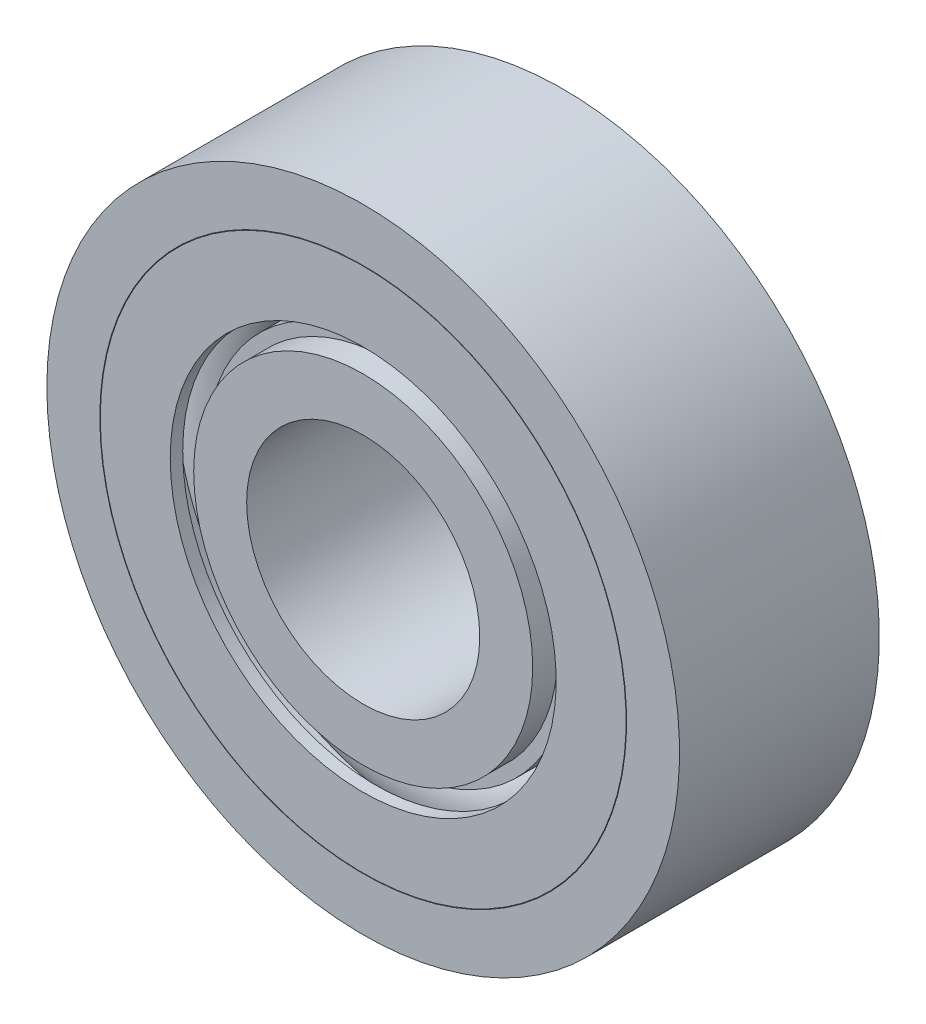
ISO-10303-21;
HEADER;
FILE_DESCRIPTION(('STEP AP214'),'2;1');
FILE_NAME('part.step','',(''),(''),'','','');
FILE_SCHEMA(('AUTOMOTIVE_DESIGN { 1 0 10303 214 1 1 1 1 }'));
ENDSEC;
DATA;
#1=APPLICATION_CONTEXT('core data for automotive mechanical design processes');
#2=APPLICATION_PROTOCOL_DEFINITION('international standard','automotive_design',2000,#1);
#3=PRODUCT_CONTEXT('',#1,'mechanical');
#4=PRODUCT('Part','Part','',(#3));
#5=PRODUCT_RELATED_PRODUCT_CATEGORY('part','',(#4));
#6=PRODUCT_DEFINITION_FORMATION('','',#4);
#7=PRODUCT_DEFINITION_CONTEXT('part definition',#1,'design');
#8=PRODUCT_DEFINITION('design','',#6,#7);
#9=PRODUCT_DEFINITION_SHAPE('','',#8);
#10=(LENGTH_UNIT() NAMED_UNIT(*) SI_UNIT(.MILLI.,.METRE.));
#11=(NAMED_UNIT(*) PLANE_ANGLE_UNIT() SI_UNIT($,.RADIAN.));
#12=(NAMED_UNIT(*) SI_UNIT($,.STERADIAN.) SOLID_ANGLE_UNIT());
#13=UNCERTAINTY_MEASURE_WITH_UNIT(LENGTH_MEASURE(1.E-05),#10,'distance_accuracy_value','');
#14=(GEOMETRIC_REPRESENTATION_CONTEXT(3) GLOBAL_UNCERTAINTY_ASSIGNED_CONTEXT((#13)) GLOBAL_UNIT_ASSIGNED_CONTEXT((#10,
#11,#12)) REPRESENTATION_CONTEXT('',''));
#15=CARTESIAN_POINT('',(0.,0.,0.));
#16=DIRECTION('',(0.,0.,1.));
#17=DIRECTION('',(1.,0.,0.));
#18=AXIS2_PLACEMENT_3D('',#15,#16,#17);
#19=CARTESIAN_POINT('',(0.,0.,3.3));
#20=DIRECTION('',(0.,0.,-1.));
#21=DIRECTION('',(-1.,0.,0.));
#22=AXIS2_PLACEMENT_3D('',#19,#20,#21);
#23=CYLINDRICAL_SURFACE('',#22,3.5);
#24=CARTESIAN_POINT('',(0.,0.,3.));
#25=DIRECTION('',(0.,0.,-1.));
#26=DIRECTION('',(-1.,0.,0.));
#27=AXIS2_PLACEMENT_3D('',#24,#25,#26);
#28=CIRCLE('',#27,3.5);
#29=CARTESIAN_POINT('',(-3.5,0.,3.));
#30=VERTEX_POINT('',#29);
#31=EDGE_CURVE('P0_E18',#30,#30,#28,.F.);
#32=ORIENTED_EDGE('',*,*,#31,.T.);
#33=EDGE_LOOP('',(#32));
#34=FACE_BOUND('',#33,.T.);
#35=CARTESIAN_POINT('',(0.,0.,-3.));
#36=DIRECTION('',(0.,0.,-1.));
#37=DIRECTION('',(-1.,0.,0.));
#38=AXIS2_PLACEMENT_3D('',#35,#36,#37);
#39=CIRCLE('',#38,3.5);
#40=CARTESIAN_POINT('',(-3.5,0.,-3.));
#41=VERTEX_POINT('',#40);
#42=EDGE_CURVE('P0_E68',#41,#41,#39,.F.);
#43=ORIENTED_EDGE('',*,*,#42,.F.);
#44=EDGE_LOOP('',(#43));
#45=FACE_BOUND('',#44,.T.);
#46=ADVANCED_FACE('P0_F15',(#34,#45),#23,.F.);
#47=CARTESIAN_POINT('',(0.,0.,3.));
#48=DIRECTION('',(0.,0.,-1.));
#49=DIRECTION('',(-1.,0.,0.));
#50=AXIS2_PLACEMENT_3D('',#47,#48,#49);
#51=PLANE('',#50);
#52=CARTESIAN_POINT('',(0.,0.,3.));
#53=DIRECTION('',(0.,0.,-1.));
#54=DIRECTION('',(-1.,0.,0.));
#55=AXIS2_PLACEMENT_3D('',#52,#53,#54);
#56=CIRCLE('',#55,5.09);
#57=CARTESIAN_POINT('',(-5.09,0.,3.));
#58=VERTEX_POINT('',#57);
#59=EDGE_CURVE('P0_E66',#58,#58,#56,.T.);
#60=ORIENTED_EDGE('',*,*,#59,.F.);
#61=EDGE_LOOP('',(#60));
#62=FACE_BOUND('',#61,.T.);
#63=ORIENTED_EDGE('',*,*,#31,.F.);
#64=EDGE_LOOP('',(#63));
#65=FACE_BOUND('',#64,.T.);
#66=ADVANCED_FACE('P0_F77',(#62,#65),#51,.F.);
#67=CARTESIAN_POINT('',(0.,0.,-3.));
#68=DIRECTION('',(0.,0.,-1.));
#69=DIRECTION('',(-1.,0.,0.));
#70=AXIS2_PLACEMENT_3D('',#67,#68,#69);
#71=PLANE('',#70);
#72=CARTESIAN_POINT('',(0.,0.,-3.));
#73=DIRECTION('',(0.,0.,-1.));
#74=DIRECTION('',(-1.,0.,0.));
#75=AXIS2_PLACEMENT_3D('',#72,#73,#74);
#76=CIRCLE('',#75,5.09);
#77=CARTESIAN_POINT('',(-5.09,0.,-3.));
#78=VERTEX_POINT('',#77);
#79=EDGE_CURVE('P0_E63',#78,#78,#76,.F.);
#80=ORIENTED_EDGE('',*,*,#79,.F.);
#81=EDGE_LOOP('',(#80));
#82=FACE_BOUND('',#81,.T.);
#83=ORIENTED_EDGE('',*,*,#42,.T.);
#84=EDGE_LOOP('',(#83));
#85=FACE_BOUND('',#84,.T.);
#86=ADVANCED_FACE('P0_F79',(#82,#85),#71,.T.);
#87=CARTESIAN_POINT('',(0.,0.,3.3));
#88=DIRECTION('',(0.,0.,-1.));
#89=DIRECTION('',(-1.,0.,0.));
#90=AXIS2_PLACEMENT_3D('',#87,#88,#89);
#91=CYLINDRICAL_SURFACE('',#90,5.09);
#92=ORIENTED_EDGE('',*,*,#59,.T.);
#93=EDGE_LOOP('',(#92));
#94=FACE_BOUND('',#93,.T.);
#95=CARTESIAN_POINT('',(0.,0.,2.25));
#96=DIRECTION('',(0.,0.,-1.));
#97=DIRECTION('',(-1.,0.,0.));
#98=AXIS2_PLACEMENT_3D('',#95,#96,#97);
#99=CIRCLE('',#98,5.09);
#100=CARTESIAN_POINT('',(-5.09,0.,2.25));
#101=VERTEX_POINT('',#100);
#102=EDGE_CURVE('P0_E60',#101,#101,#99,.F.);
#103=ORIENTED_EDGE('',*,*,#102,.T.);
#104=EDGE_LOOP('',(#103));
#105=FACE_BOUND('',#104,.T.);
#106=ADVANCED_FACE('P0_F86',(#94,#105),#91,.T.);
#107=CARTESIAN_POINT('',(0.,0.,3.3));
#108=DIRECTION('',(0.,0.,-1.));
#109=DIRECTION('',(-1.,0.,0.));
#110=AXIS2_PLACEMENT_3D('',#107,#108,#109);
#111=CYLINDRICAL_SURFACE('',#110,5.09);
#112=ORIENTED_EDGE('',*,*,#79,.T.);
#113=EDGE_LOOP('',(#112));
#114=FACE_BOUND('',#113,.T.);
#115=CARTESIAN_POINT('',(0.,0.,-2.25));
#116=DIRECTION('',(0.,0.,-1.));
#117=DIRECTION('',(-1.,0.,0.));
#118=AXIS2_PLACEMENT_3D('',#115,#116,#117);
#119=CIRCLE('',#118,5.09);
#120=CARTESIAN_POINT('',(-5.09,0.,-2.25));
#121=VERTEX_POINT('',#120);
#122=EDGE_CURVE('P0_E57',#121,#121,#119,.F.);
#123=ORIENTED_EDGE('',*,*,#122,.F.);
#124=EDGE_LOOP('',(#123));
#125=FACE_BOUND('',#124,.T.);
#126=ADVANCED_FACE('P0_F173',(#114,#125),#111,.T.);
#127=CARTESIAN_POINT('',(0.,0.,2.25));
#128=DIRECTION('',(0.,0.,-1.));
#129=DIRECTION('',(-1.,0.,0.));
#130=AXIS2_PLACEMENT_3D('',#127,#128,#129);
#131=PLANE('',#130);
#132=CARTESIAN_POINT('',(0.,0.,2.25));
#133=DIRECTION('',(0.,0.,-1.));
#134=DIRECTION('',(-1.,0.,0.));
#135=AXIS2_PLACEMENT_3D('',#132,#133,#134);
#136=CIRCLE('',#135,5.456);
#137=CARTESIAN_POINT('',(-5.456,0.,2.25));
#138=VERTEX_POINT('',#137);
#139=EDGE_CURVE('P0_E54',#138,#138,#136,.T.);
#140=ORIENTED_EDGE('',*,*,#139,.F.);
#141=EDGE_LOOP('',(#140));
#142=FACE_BOUND('',#141,.T.);
#143=ORIENTED_EDGE('',*,*,#102,.F.);
#144=EDGE_LOOP('',(#143));
#145=FACE_BOUND('',#144,.T.);
#146=ADVANCED_FACE('P0_F167',(#142,#145),#131,.F.);
#147=CARTESIAN_POINT('',(0.,0.,-2.25));
#148=DIRECTION('',(0.,0.,-1.));
#149=DIRECTION('',(-1.,0.,0.));
#150=AXIS2_PLACEMENT_3D('',#147,#148,#149);
#151=PLANE('',#150);
#152=CARTESIAN_POINT('',(0.,0.,-2.25));
#153=DIRECTION('',(0.,0.,-1.));
#154=DIRECTION('',(-1.,0.,0.));
#155=AXIS2_PLACEMENT_3D('',#152,#153,#154);
#156=CIRCLE('',#155,5.456);
#157=CARTESIAN_POINT('',(-5.456,0.,-2.25));
#158=VERTEX_POINT('',#157);
#159=EDGE_CURVE('P0_E51',#158,#158,#156,.F.);
#160=ORIENTED_EDGE('',*,*,#159,.F.);
#161=EDGE_LOOP('',(#160));
#162=FACE_BOUND('',#161,.T.);
#163=ORIENTED_EDGE('',*,*,#122,.T.);
#164=EDGE_LOOP('',(#163));
#165=FACE_BOUND('',#164,.T.);
#166=ADVANCED_FACE('P0_F159',(#162,#165),#151,.T.);
#167=CARTESIAN_POINT('',(0.,0.,3.3));
#168=DIRECTION('',(0.,0.,-1.));
#169=DIRECTION('',(-1.,0.,0.));
#170=AXIS2_PLACEMENT_3D('',#167,#168,#169);
#171=CYLINDRICAL_SURFACE('',#170,5.456);
#172=ORIENTED_EDGE('',*,*,#139,.T.);
#173=EDGE_LOOP('',(#172));
#174=FACE_BOUND('',#173,.T.);
#175=CARTESIAN_POINT('',(0.,0.,1.09094637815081));
#176=DIRECTION('',(0.,0.,-1.));
#177=DIRECTION('',(0.,-1.,0.));
#178=AXIS2_PLACEMENT_3D('',#175,#176,#177);
#179=CIRCLE('',#178,5.45600000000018);
#180=CARTESIAN_POINT('',(0.,-5.45600000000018,1.09094637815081));
#181=VERTEX_POINT('',#180);
#182=EDGE_CURVE('P0_E30',#181,#181,#179,.T.);
#183=ORIENTED_EDGE('',*,*,#182,.F.);
#184=EDGE_LOOP('',(#183));
#185=FACE_BOUND('',#184,.T.);
#186=ADVANCED_FACE('P0_F156',(#174,#185),#171,.T.);
#187=CARTESIAN_POINT('',(0.,0.,3.3));
#188=DIRECTION('',(0.,0.,-1.));
#189=DIRECTION('',(-1.,0.,0.));
#190=AXIS2_PLACEMENT_3D('',#187,#188,#189);
#191=CYLINDRICAL_SURFACE('',#190,5.456);
#192=CARTESIAN_POINT('',(0.,0.,-1.09094637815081));
#193=DIRECTION('',(0.,0.,-1.));
#194=DIRECTION('',(0.,-1.,0.));
#195=AXIS2_PLACEMENT_3D('',#192,#193,#194);
#196=CIRCLE('',#195,5.45600000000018);
#197=CARTESIAN_POINT('',(0.,-5.45600000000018,-1.09094637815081));
#198=VERTEX_POINT('',#197);
#199=EDGE_CURVE('P0_E146',#198,#198,#196,.F.);
#200=ORIENTED_EDGE('',*,*,#199,.F.);
#201=EDGE_LOOP('',(#200));
#202=FACE_BOUND('',#201,.T.);
#203=ORIENTED_EDGE('',*,*,#159,.T.);
#204=EDGE_LOOP('',(#203));
#205=FACE_BOUND('',#204,.T.);
#206=ADVANCED_FACE('P0_F158',(#202,#205),#191,.T.);
#207=CARTESIAN_POINT('',(0.,0.,0.));
#208=DIRECTION('',(0.,0.,-1.));
#209=DIRECTION('',(0.,-1.,0.));
#210=AXIS2_PLACEMENT_3D('',#207,#208,#209);
#211=TOROIDAL_SURFACE('',#210,6.5,1.51);
#212=ORIENTED_EDGE('',*,*,#182,.T.);
#213=EDGE_LOOP('',(#212));
#214=FACE_BOUND('',#213,.T.);
#215=CARTESIAN_POINT('',(0.,0.,1.090946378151));
#216=DIRECTION('',(0.,0.,-1.));
#217=DIRECTION('',(-1.,0.,0.));
#218=AXIS2_PLACEMENT_3D('',#215,#216,#217);
#219=CIRCLE('',#218,7.544);
#220=CARTESIAN_POINT('',(-7.544,0.,1.090946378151));
#221=VERTEX_POINT('',#220);
#222=EDGE_CURVE('P0_E144',#221,#221,#219,.F.);
#223=ORIENTED_EDGE('',*,*,#222,.T.);
#224=EDGE_LOOP('',(#223));
#225=FACE_BOUND('',#224,.T.);
#226=ADVANCED_FACE('P0_F137',(#214,#225),#211,.T.);
#227=CARTESIAN_POINT('',(0.,0.,0.));
#228=DIRECTION('',(0.,0.,-1.));
#229=DIRECTION('',(0.,-1.,0.));
#230=AXIS2_PLACEMENT_3D('',#227,#228,#229);
#231=TOROIDAL_SURFACE('',#230,6.5,1.51);
#232=CARTESIAN_POINT('',(0.,0.,-1.090946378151));
#233=DIRECTION('',(0.,0.,-1.));
#234=DIRECTION('',(-1.,0.,0.));
#235=AXIS2_PLACEMENT_3D('',#232,#233,#234);
#236=CIRCLE('',#235,7.544);
#237=CARTESIAN_POINT('',(-7.544,0.,-1.090946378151));
#238=VERTEX_POINT('',#237);
#239=EDGE_CURVE('P0_E50',#238,#238,#236,.T.);
#240=ORIENTED_EDGE('',*,*,#239,.T.);
#241=EDGE_LOOP('',(#240));
#242=FACE_BOUND('',#241,.T.);
#243=ORIENTED_EDGE('',*,*,#199,.T.);
#244=EDGE_LOOP('',(#243));
#245=FACE_BOUND('',#244,.T.);
#246=ADVANCED_FACE('P0_F132',(#242,#245),#231,.T.);
#247=CARTESIAN_POINT('',(0.,0.,3.3));
#248=DIRECTION('',(0.,0.,-1.));
#249=DIRECTION('',(-1.,0.,0.));
#250=AXIS2_PLACEMENT_3D('',#247,#248,#249);
#251=CYLINDRICAL_SURFACE('',#250,7.544);
#252=ORIENTED_EDGE('',*,*,#222,.F.);
#253=EDGE_LOOP('',(#252));
#254=FACE_BOUND('',#253,.T.);
#255=CARTESIAN_POINT('',(0.,0.,2.25));
#256=DIRECTION('',(0.,0.,-1.));
#257=DIRECTION('',(-1.,0.,0.));
#258=AXIS2_PLACEMENT_3D('',#255,#256,#257);
#259=CIRCLE('',#258,7.544);
#260=CARTESIAN_POINT('',(-7.544,0.,2.25));
#261=VERTEX_POINT('',#260);
#262=EDGE_CURVE('P0_E47',#261,#261,#259,.F.);
#263=ORIENTED_EDGE('',*,*,#262,.T.);
#264=EDGE_LOOP('',(#263));
#265=FACE_BOUND('',#264,.T.);
#266=ADVANCED_FACE('P0_F128',(#254,#265),#251,.F.);
#267=CARTESIAN_POINT('',(0.,0.,3.3));
#268=DIRECTION('',(0.,0.,-1.));
#269=DIRECTION('',(-1.,0.,0.));
#270=AXIS2_PLACEMENT_3D('',#267,#268,#269);
#271=CYLINDRICAL_SURFACE('',#270,7.544);
#272=ORIENTED_EDGE('',*,*,#239,.F.);
#273=EDGE_LOOP('',(#272));
#274=FACE_BOUND('',#273,.T.);
#275=CARTESIAN_POINT('',(0.,0.,-2.25));
#276=DIRECTION('',(0.,0.,-1.));
#277=DIRECTION('',(-1.,0.,0.));
#278=AXIS2_PLACEMENT_3D('',#275,#276,#277);
#279=CIRCLE('',#278,7.544);
#280=CARTESIAN_POINT('',(-7.544,0.,-2.25));
#281=VERTEX_POINT('',#280);
#282=EDGE_CURVE('P0_E44',#281,#281,#279,.F.);
#283=ORIENTED_EDGE('',*,*,#282,.F.);
#284=EDGE_LOOP('',(#283));
#285=FACE_BOUND('',#284,.T.);
#286=ADVANCED_FACE('P0_F124',(#274,#285),#271,.F.);
#287=CARTESIAN_POINT('',(0.,0.,2.25));
#288=DIRECTION('',(0.,0.,-1.));
#289=DIRECTION('',(-1.,0.,0.));
#290=AXIS2_PLACEMENT_3D('',#287,#288,#289);
#291=PLANE('',#290);
#292=CARTESIAN_POINT('',(0.,0.,2.25));
#293=DIRECTION('',(0.,0.,-1.));
#294=DIRECTION('',(-1.,0.,0.));
#295=AXIS2_PLACEMENT_3D('',#292,#293,#294);
#296=CIRCLE('',#295,7.91);
#297=CARTESIAN_POINT('',(-7.91,0.,2.25));
#298=VERTEX_POINT('',#297);
#299=EDGE_CURVE('P0_E41',#298,#298,#296,.F.);
#300=ORIENTED_EDGE('',*,*,#299,.T.);
#301=EDGE_LOOP('',(#300));
#302=FACE_BOUND('',#301,.T.);
#303=ORIENTED_EDGE('',*,*,#262,.F.);
#304=EDGE_LOOP('',(#303));
#305=FACE_BOUND('',#304,.T.);
#306=ADVANCED_FACE('P0_F120',(#302,#305),#291,.F.);
#307=CARTESIAN_POINT('',(0.,0.,-2.25));
#308=DIRECTION('',(0.,0.,-1.));
#309=DIRECTION('',(-1.,0.,0.));
#310=AXIS2_PLACEMENT_3D('',#307,#308,#309);
#311=PLANE('',#310);
#312=CARTESIAN_POINT('',(0.,0.,-2.25));
#313=DIRECTION('',(0.,0.,-1.));
#314=DIRECTION('',(-1.,0.,0.));
#315=AXIS2_PLACEMENT_3D('',#312,#313,#314);
#316=CIRCLE('',#315,7.91);
#317=CARTESIAN_POINT('',(-7.91,0.,-2.25));
#318=VERTEX_POINT('',#317);
#319=EDGE_CURVE('P0_E38',#318,#318,#316,.T.);
#320=ORIENTED_EDGE('',*,*,#319,.T.);
#321=EDGE_LOOP('',(#320));
#322=FACE_BOUND('',#321,.T.);
#323=ORIENTED_EDGE('',*,*,#282,.T.);
#324=EDGE_LOOP('',(#323));
#325=FACE_BOUND('',#324,.T.);
#326=ADVANCED_FACE('P0_F116',(#322,#325),#311,.T.);
#327=CARTESIAN_POINT('',(0.,0.,3.3));
#328=DIRECTION('',(0.,0.,-1.));
#329=DIRECTION('',(-1.,0.,0.));
#330=AXIS2_PLACEMENT_3D('',#327,#328,#329);
#331=CYLINDRICAL_SURFACE('',#330,7.91);
#332=ORIENTED_EDGE('',*,*,#299,.F.);
#333=EDGE_LOOP('',(#332));
#334=FACE_BOUND('',#333,.T.);
#335=CARTESIAN_POINT('',(0.,0.,3.));
#336=DIRECTION('',(0.,0.,-1.));
#337=DIRECTION('',(-1.,0.,0.));
#338=AXIS2_PLACEMENT_3D('',#335,#336,#337);
#339=CIRCLE('',#338,7.91);
#340=CARTESIAN_POINT('',(-7.91,0.,3.));
#341=VERTEX_POINT('',#340);
#342=EDGE_CURVE('P0_E35',#341,#341,#339,.F.);
#343=ORIENTED_EDGE('',*,*,#342,.T.);
#344=EDGE_LOOP('',(#343));
#345=FACE_BOUND('',#344,.T.);
#346=ADVANCED_FACE('P0_F112',(#334,#345),#331,.F.);
#347=CARTESIAN_POINT('',(0.,0.,3.3));
#348=DIRECTION('',(0.,0.,-1.));
#349=DIRECTION('',(-1.,0.,0.));
#350=AXIS2_PLACEMENT_3D('',#347,#348,#349);
#351=CYLINDRICAL_SURFACE('',#350,7.91);
#352=ORIENTED_EDGE('',*,*,#319,.F.);
#353=EDGE_LOOP('',(#352));
#354=FACE_BOUND('',#353,.T.);
#355=CARTESIAN_POINT('',(0.,0.,-3.));
#356=DIRECTION('',(0.,0.,-1.));
#357=DIRECTION('',(-1.,0.,0.));
#358=AXIS2_PLACEMENT_3D('',#355,#356,#357);
#359=CIRCLE('',#358,7.91);
#360=CARTESIAN_POINT('',(-7.91,0.,-3.));
#361=VERTEX_POINT('',#360);
#362=EDGE_CURVE('P0_E27',#361,#361,#359,.F.);
#363=ORIENTED_EDGE('',*,*,#362,.F.);
#364=EDGE_LOOP('',(#363));
#365=FACE_BOUND('',#364,.T.);
#366=ADVANCED_FACE('P0_F108',(#354,#365),#351,.F.);
#367=CARTESIAN_POINT('',(0.,0.,3.));
#368=DIRECTION('',(0.,0.,-1.));
#369=DIRECTION('',(-1.,0.,0.));
#370=AXIS2_PLACEMENT_3D('',#367,#368,#369);
#371=PLANE('',#370);
#372=CARTESIAN_POINT('',(0.,0.,3.));
#373=DIRECTION('',(0.,0.,-1.));
#374=DIRECTION('',(-1.,0.,0.));
#375=AXIS2_PLACEMENT_3D('',#372,#373,#374);
#376=CIRCLE('',#375,9.5);
#377=CARTESIAN_POINT('',(-9.5,0.,3.));
#378=VERTEX_POINT('',#377);
#379=EDGE_CURVE('P0_E22',#378,#378,#376,.T.);
#380=ORIENTED_EDGE('',*,*,#379,.F.);
#381=EDGE_LOOP('',(#380));
#382=FACE_BOUND('',#381,.T.);
#383=ORIENTED_EDGE('',*,*,#342,.F.);
#384=EDGE_LOOP('',(#383));
#385=FACE_BOUND('',#384,.T.);
#386=ADVANCED_FACE('P0_F98',(#382,#385),#371,.F.);
#387=CARTESIAN_POINT('',(0.,0.,-3.));
#388=DIRECTION('',(0.,0.,-1.));
#389=DIRECTION('',(-1.,0.,0.));
#390=AXIS2_PLACEMENT_3D('',#387,#388,#389);
#391=PLANE('',#390);
#392=CARTESIAN_POINT('',(0.,0.,-3.));
#393=DIRECTION('',(0.,0.,-1.));
#394=DIRECTION('',(-1.,0.,0.));
#395=AXIS2_PLACEMENT_3D('',#392,#393,#394);
#396=CIRCLE('',#395,9.5);
#397=CARTESIAN_POINT('',(-9.5,0.,-3.));
#398=VERTEX_POINT('',#397);
#399=EDGE_CURVE('P0_E10',#398,#398,#396,.F.);
#400=ORIENTED_EDGE('',*,*,#399,.F.);
#401=EDGE_LOOP('',(#400));
#402=FACE_BOUND('',#401,.T.);
#403=ORIENTED_EDGE('',*,*,#362,.T.);
#404=EDGE_LOOP('',(#403));
#405=FACE_BOUND('',#404,.T.);
#406=ADVANCED_FACE('P0_F92',(#402,#405),#391,.T.);
#407=CARTESIAN_POINT('',(0.,0.,3.3));
#408=DIRECTION('',(0.,0.,-1.));
#409=DIRECTION('',(-1.,0.,0.));
#410=AXIS2_PLACEMENT_3D('',#407,#408,#409);
#411=CYLINDRICAL_SURFACE('',#410,9.5);
#412=ORIENTED_EDGE('',*,*,#399,.T.);
#413=EDGE_LOOP('',(#412));
#414=FACE_BOUND('',#413,.T.);
#415=ORIENTED_EDGE('',*,*,#379,.T.);
#416=EDGE_LOOP('',(#415));
#417=FACE_BOUND('',#416,.T.);
#418=ADVANCED_FACE('P0_F90',(#414,#417),#411,.T.);
#419=CLOSED_SHELL('',(#46,#66,#86,#106,#126,#146,#166,#186,#206,#226,#246,#266,#286,#306,#326,
#346,#366,#386,#406,#418));
#420=CARTESIAN_POINT('',(0.,0.,0.));
#421=DIRECTION('',(0.,0.,-1.));
#422=DIRECTION('',(0.,-1.,0.));
#423=AXIS2_PLACEMENT_3D('',#420,#421,#422);
#424=TOROIDAL_SURFACE('',#423,6.5,1.5);
#425=ADVANCED_FACE('P0_F103',(),#424,.F.);
#426=CLOSED_SHELL('',(#425));
#427=ORIENTED_CLOSED_SHELL('',*,#426,.T.);
#428=BREP_WITH_VOIDS('P0_B1',#419,(#427));
#429=CARTESIAN_POINT('',(0.,0.,2.625));
#430=DIRECTION('',(0.,0.,-1.));
#431=DIRECTION('',(-1.,0.,0.));
#432=AXIS2_PLACEMENT_3D('',#429,#430,#431);
#433=PLANE('',#432);
#434=CARTESIAN_POINT('',(0.,0.,2.625));
#435=DIRECTION('',(0.,0.,-1.));
#436=DIRECTION('',(-1.,0.,0.));
#437=AXIS2_PLACEMENT_3D('',#434,#435,#436);
#438=CIRCLE('',#437,7.895);
#439=CARTESIAN_POINT('',(-7.895,0.,2.625));
#440=VERTEX_POINT('',#439);
#441=EDGE_CURVE('P1_E26',#440,#440,#438,.F.);
#442=ORIENTED_EDGE('',*,*,#441,.F.);
#443=EDGE_LOOP('',(#442));
#444=FACE_BOUND('',#443,.T.);
#445=CARTESIAN_POINT('',(0.,0.,2.625));
#446=DIRECTION('',(0.,0.,-1.));
#447=DIRECTION('',(-1.,0.,0.));
#448=AXIS2_PLACEMENT_3D('',#445,#446,#447);
#449=CIRCLE('',#448,5.795);
#450=CARTESIAN_POINT('',(-5.795,0.,2.625));
#451=VERTEX_POINT('',#450);
#452=EDGE_CURVE('P1_E17',#451,#451,#449,.F.);
#453=ORIENTED_EDGE('',*,*,#452,.T.);
#454=EDGE_LOOP('',(#453));
#455=FACE_BOUND('',#454,.T.);
#456=ADVANCED_FACE('P1_F14',(#444,#455),#433,.T.);
#457=CARTESIAN_POINT('',(0.,0.,3.3));
#458=DIRECTION('',(0.,0.,-1.));
#459=DIRECTION('',(-1.,0.,0.));
#460=AXIS2_PLACEMENT_3D('',#457,#458,#459);
#461=CYLINDRICAL_SURFACE('',#460,5.795);
#462=ORIENTED_EDGE('',*,*,#452,.F.);
#463=EDGE_LOOP('',(#462));
#464=FACE_BOUND('',#463,.T.);
#465=CARTESIAN_POINT('',(0.,0.,3.));
#466=DIRECTION('',(0.,0.,-1.));
#467=DIRECTION('',(-1.,0.,0.));
#468=AXIS2_PLACEMENT_3D('',#465,#466,#467);
#469=CIRCLE('',#468,5.795);
#470=CARTESIAN_POINT('',(-5.795,0.,3.));
#471=VERTEX_POINT('',#470);
#472=EDGE_CURVE('P1_E21',#471,#471,#469,.F.);
#473=ORIENTED_EDGE('',*,*,#472,.T.);
#474=EDGE_LOOP('',(#473));
#475=FACE_BOUND('',#474,.T.);
#476=ADVANCED_FACE('P1_F35',(#464,#475),#461,.F.);
#477=CARTESIAN_POINT('',(0.,0.,3.3));
#478=DIRECTION('',(0.,0.,-1.));
#479=DIRECTION('',(-1.,0.,0.));
#480=AXIS2_PLACEMENT_3D('',#477,#478,#479);
#481=CYLINDRICAL_SURFACE('',#480,7.895);
#482=ORIENTED_EDGE('',*,*,#441,.T.);
#483=EDGE_LOOP('',(#482));
#484=FACE_BOUND('',#483,.T.);
#485=CARTESIAN_POINT('',(0.,0.,3.));
#486=DIRECTION('',(0.,0.,-1.));
#487=DIRECTION('',(-1.,0.,0.));
#488=AXIS2_PLACEMENT_3D('',#485,#486,#487);
#489=CIRCLE('',#488,7.895);
#490=CARTESIAN_POINT('',(-7.895,0.,3.));
#491=VERTEX_POINT('',#490);
#492=EDGE_CURVE('P1_E10',#491,#491,#489,.T.);
#493=ORIENTED_EDGE('',*,*,#492,.T.);
#494=EDGE_LOOP('',(#493));
#495=FACE_BOUND('',#494,.T.);
#496=ADVANCED_FACE('P1_F38',(#484,#495),#481,.T.);
#497=CARTESIAN_POINT('',(0.,0.,3.));
#498=DIRECTION('',(0.,0.,-1.));
#499=DIRECTION('',(-1.,0.,0.));
#500=AXIS2_PLACEMENT_3D('',#497,#498,#499);
#501=PLANE('',#500);
#502=ORIENTED_EDGE('',*,*,#492,.F.);
#503=EDGE_LOOP('',(#502));
#504=FACE_BOUND('',#503,.T.);
#505=ORIENTED_EDGE('',*,*,#472,.F.);
#506=EDGE_LOOP('',(#505));
#507=FACE_BOUND('',#506,.T.);
#508=ADVANCED_FACE('P1_F41',(#504,#507),#501,.F.);
#509=CLOSED_SHELL('',(#456,#476,#496,#508));
#510=MANIFOLD_SOLID_BREP('P1_B1',#509);
#511=ADVANCED_BREP_SHAPE_REPRESENTATION('',(#18,#428,#510),#14);
#512=SHAPE_DEFINITION_REPRESENTATION(#9,#511);
ENDSEC;
END-ISO-10303-21;
